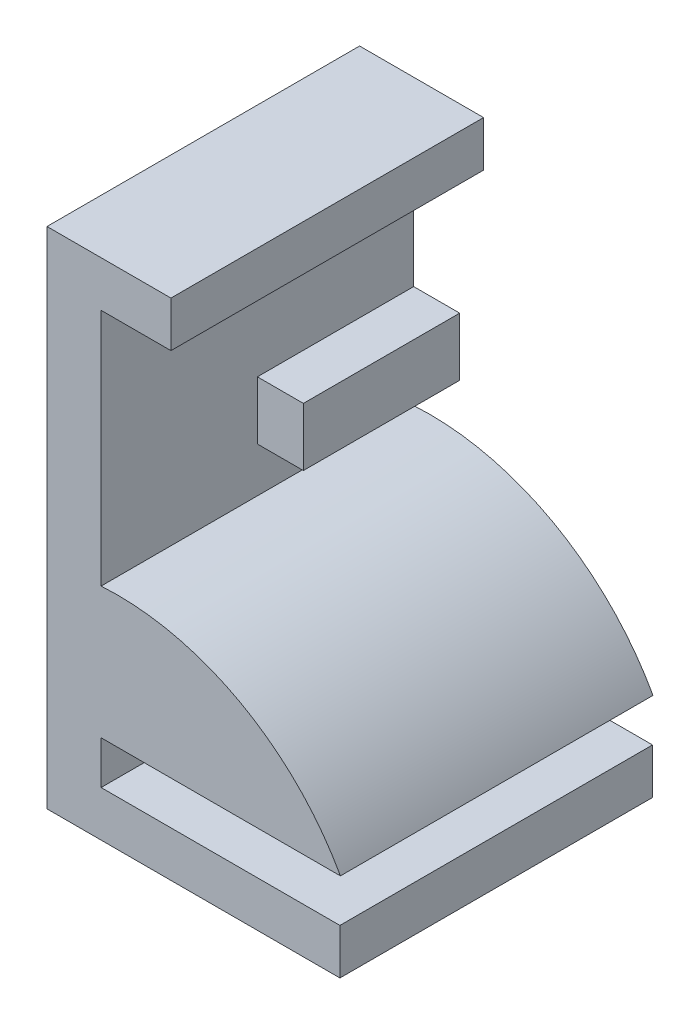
ISO-10303-21;
HEADER;
FILE_DESCRIPTION(('STEP AP214'),'2;1');
FILE_NAME('part.step','',(''),(''),'','','');
FILE_SCHEMA(('AUTOMOTIVE_DESIGN { 1 0 10303 214 1 1 1 1 }'));
ENDSEC;
DATA;
#1=APPLICATION_CONTEXT('core data for automotive mechanical design processes');
#2=APPLICATION_PROTOCOL_DEFINITION('international standard','automotive_design',2000,#1);
#3=PRODUCT_CONTEXT('',#1,'mechanical');
#4=PRODUCT('Part','Part','',(#3));
#5=PRODUCT_RELATED_PRODUCT_CATEGORY('part','',(#4));
#6=PRODUCT_DEFINITION_FORMATION('','',#4);
#7=PRODUCT_DEFINITION_CONTEXT('part definition',#1,'design');
#8=PRODUCT_DEFINITION('design','',#6,#7);
#9=PRODUCT_DEFINITION_SHAPE('','',#8);
#10=(LENGTH_UNIT() NAMED_UNIT(*) SI_UNIT(.MILLI.,.METRE.));
#11=(NAMED_UNIT(*) PLANE_ANGLE_UNIT() SI_UNIT($,.RADIAN.));
#12=(NAMED_UNIT(*) SI_UNIT($,.STERADIAN.) SOLID_ANGLE_UNIT());
#13=UNCERTAINTY_MEASURE_WITH_UNIT(LENGTH_MEASURE(1.E-05),#10,'distance_accuracy_value','');
#14=(GEOMETRIC_REPRESENTATION_CONTEXT(3) GLOBAL_UNCERTAINTY_ASSIGNED_CONTEXT((#13)) GLOBAL_UNIT_ASSIGNED_CONTEXT((#10,
#11,#12)) REPRESENTATION_CONTEXT('',''));
#15=CARTESIAN_POINT('',(0.,0.,0.));
#16=DIRECTION('',(0.,0.,1.));
#17=DIRECTION('',(1.,0.,0.));
#18=AXIS2_PLACEMENT_3D('',#15,#16,#17);
#19=CARTESIAN_POINT('',(152.004557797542,-86.5512105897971,47.5));
#20=DIRECTION('',(0.,1.,0.));
#21=DIRECTION('',(0.,0.,1.));
#22=AXIS2_PLACEMENT_3D('',#19,#20,#21);
#23=PLANE('',#22);
#24=DIRECTION('',(1.,0.,0.));
#25=VECTOR('',#24,1.);
#26=CARTESIAN_POINT('',(152.004557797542,-86.5512105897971,-47.5));
#27=LINE('',#26,#25);
#28=CARTESIAN_POINT('',(62.9855483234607,-86.5512105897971,-47.5));
#29=VERTEX_POINT('',#28);
#30=CARTESIAN_POINT('',(152.004557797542,-86.5512105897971,-47.5));
#31=VERTEX_POINT('',#30);
#32=EDGE_CURVE('E147',#29,#31,#27,.T.);
#33=ORIENTED_EDGE('',*,*,#32,.T.);
#34=DIRECTION('',(0.,0.,-1.));
#35=VECTOR('',#34,1.);
#36=CARTESIAN_POINT('',(152.004557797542,-86.5512105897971,47.5));
#37=LINE('',#36,#35);
#38=CARTESIAN_POINT('',(152.004557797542,-86.5512105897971,47.5));
#39=VERTEX_POINT('',#38);
#40=EDGE_CURVE('E11',#39,#31,#37,.T.);
#41=ORIENTED_EDGE('',*,*,#40,.F.);
#42=DIRECTION('',(1.,0.,0.));
#43=VECTOR('',#42,1.);
#44=CARTESIAN_POINT('',(152.004557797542,-86.5512105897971,47.5));
#45=LINE('',#44,#43);
#46=CARTESIAN_POINT('',(62.9855483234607,-86.5512105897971,47.5));
#47=VERTEX_POINT('',#46);
#48=EDGE_CURVE('E223',#47,#39,#45,.T.);
#49=ORIENTED_EDGE('',*,*,#48,.F.);
#50=DIRECTION('',(0.,0.,-1.));
#51=VECTOR('',#50,1.);
#52=CARTESIAN_POINT('',(62.9855483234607,-86.5512105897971,47.5));
#53=LINE('',#52,#51);
#54=EDGE_CURVE('E242',#47,#29,#53,.T.);
#55=ORIENTED_EDGE('',*,*,#54,.T.);
#56=EDGE_LOOP('',(#33,#41,#49,#55));
#57=FACE_BOUND('',#56,.T.);
#58=ADVANCED_FACE('F32',(#57),#23,.F.);
#59=CARTESIAN_POINT('',(152.004557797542,-86.5512105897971,47.5));
#60=DIRECTION('',(-1.,0.,0.));
#61=DIRECTION('',(0.,0.,1.));
#62=AXIS2_PLACEMENT_3D('',#59,#60,#61);
#63=PLANE('',#62);
#64=DIRECTION('',(0.,1.,0.));
#65=VECTOR('',#64,1.);
#66=CARTESIAN_POINT('',(152.004557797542,-86.5512105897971,-47.5));
#67=LINE('',#66,#65);
#68=CARTESIAN_POINT('',(152.004557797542,-72.710314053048,-47.5));
#69=VERTEX_POINT('',#68);
#70=EDGE_CURVE('E192',#31,#69,#67,.T.);
#71=ORIENTED_EDGE('',*,*,#70,.T.);
#72=DIRECTION('',(0.,0.,-1.));
#73=VECTOR('',#72,1.);
#74=CARTESIAN_POINT('',(152.004557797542,-72.710314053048,47.5));
#75=LINE('',#74,#73);
#76=CARTESIAN_POINT('',(152.004557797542,-72.710314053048,47.5));
#77=VERTEX_POINT('',#76);
#78=EDGE_CURVE('E39',#77,#69,#75,.T.);
#79=ORIENTED_EDGE('',*,*,#78,.F.);
#80=DIRECTION('',(0.,1.,0.));
#81=VECTOR('',#80,1.);
#82=CARTESIAN_POINT('',(152.004557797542,-86.5512105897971,47.5));
#83=LINE('',#82,#81);
#84=EDGE_CURVE('E225',#39,#77,#83,.T.);
#85=ORIENTED_EDGE('',*,*,#84,.F.);
#86=ORIENTED_EDGE('',*,*,#40,.T.);
#87=EDGE_LOOP('',(#71,#79,#85,#86));
#88=FACE_BOUND('',#87,.T.);
#89=ADVANCED_FACE('F292',(#88),#63,.F.);
#90=CARTESIAN_POINT('',(152.004557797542,-72.710314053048,47.5));
#91=DIRECTION('',(0.,-1.,0.));
#92=DIRECTION('',(1.,0.,0.));
#93=AXIS2_PLACEMENT_3D('',#90,#91,#92);
#94=PLANE('',#93);
#95=DIRECTION('',(-1.,0.,0.));
#96=VECTOR('',#95,1.);
#97=CARTESIAN_POINT('',(152.004557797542,-72.710314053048,-47.5));
#98=LINE('',#97,#96);
#99=CARTESIAN_POINT('',(79.4274220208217,-72.7103140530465,-47.5));
#100=VERTEX_POINT('',#99);
#101=EDGE_CURVE('E185',#69,#100,#98,.T.);
#102=ORIENTED_EDGE('',*,*,#101,.T.);
#103=DIRECTION('',(0.,0.,-1.));
#104=VECTOR('',#103,1.);
#105=CARTESIAN_POINT('',(79.4274220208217,-72.7103140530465,47.5));
#106=LINE('',#105,#104);
#107=CARTESIAN_POINT('',(79.4274220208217,-72.7103140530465,47.5));
#108=VERTEX_POINT('',#107);
#109=EDGE_CURVE('E176',#108,#100,#106,.T.);
#110=ORIENTED_EDGE('',*,*,#109,.F.);
#111=DIRECTION('',(-1.,0.,0.));
#112=VECTOR('',#111,1.);
#113=CARTESIAN_POINT('',(152.004557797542,-72.710314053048,47.5));
#114=LINE('',#113,#112);
#115=EDGE_CURVE('E186',#77,#108,#114,.T.);
#116=ORIENTED_EDGE('',*,*,#115,.F.);
#117=ORIENTED_EDGE('',*,*,#78,.T.);
#118=EDGE_LOOP('',(#102,#110,#116,#117));
#119=FACE_BOUND('',#118,.T.);
#120=ADVANCED_FACE('F183',(#119),#94,.F.);
#121=CARTESIAN_POINT('',(79.4274220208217,-72.7103140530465,47.5));
#122=DIRECTION('',(-1.,0.,0.));
#123=DIRECTION('',(0.,0.,1.));
#124=AXIS2_PLACEMENT_3D('',#121,#122,#123);
#125=PLANE('',#124);
#126=DIRECTION('',(0.,1.,0.));
#127=VECTOR('',#126,1.);
#128=CARTESIAN_POINT('',(79.4274220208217,-72.7103140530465,-47.5));
#129=LINE('',#128,#127);
#130=CARTESIAN_POINT('',(79.4274220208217,-59.6076484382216,-47.5));
#131=VERTEX_POINT('',#130);
#132=EDGE_CURVE('E194',#100,#131,#129,.T.);
#133=ORIENTED_EDGE('',*,*,#132,.T.);
#134=DIRECTION('',(0.,0.,-1.));
#135=VECTOR('',#134,1.);
#136=CARTESIAN_POINT('',(79.4274220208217,-59.6076484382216,47.5));
#137=LINE('',#136,#135);
#138=CARTESIAN_POINT('',(79.4274220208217,-59.6076484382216,47.5));
#139=VERTEX_POINT('',#138);
#140=EDGE_CURVE('E173',#139,#131,#137,.T.);
#141=ORIENTED_EDGE('',*,*,#140,.F.);
#142=DIRECTION('',(0.,1.,0.));
#143=VECTOR('',#142,1.);
#144=CARTESIAN_POINT('',(79.4274220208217,-72.7103140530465,47.5));
#145=LINE('',#144,#143);
#146=EDGE_CURVE('E228',#108,#139,#145,.T.);
#147=ORIENTED_EDGE('',*,*,#146,.F.);
#148=ORIENTED_EDGE('',*,*,#109,.T.);
#149=EDGE_LOOP('',(#133,#141,#147,#148));
#150=FACE_BOUND('',#149,.T.);
#151=ADVANCED_FACE('F289',(#150),#125,.F.);
#152=CARTESIAN_POINT('',(79.4274220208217,-59.6076484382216,47.5));
#153=DIRECTION('',(0.,1.,0.));
#154=DIRECTION('',(0.,0.,1.));
#155=AXIS2_PLACEMENT_3D('',#152,#153,#154);
#156=PLANE('',#155);
#157=DIRECTION('',(1.,0.,0.));
#158=VECTOR('',#157,1.);
#159=CARTESIAN_POINT('',(79.4274220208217,-59.6076484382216,-47.5));
#160=LINE('',#159,#158);
#161=CARTESIAN_POINT('',(152.150409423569,-59.6076484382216,-47.5));
#162=VERTEX_POINT('',#161);
#163=EDGE_CURVE('E196',#131,#162,#160,.T.);
#164=ORIENTED_EDGE('',*,*,#163,.T.);
#165=DIRECTION('',(0.,0.,-1.));
#166=VECTOR('',#165,1.);
#167=CARTESIAN_POINT('',(152.150409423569,-59.6076484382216,47.5));
#168=LINE('',#167,#166);
#169=CARTESIAN_POINT('',(152.150409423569,-59.6076484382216,47.5));
#170=VERTEX_POINT('',#169);
#171=EDGE_CURVE('E165',#170,#162,#168,.T.);
#172=ORIENTED_EDGE('',*,*,#171,.F.);
#173=DIRECTION('',(1.,0.,0.));
#174=VECTOR('',#173,1.);
#175=CARTESIAN_POINT('',(79.4274220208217,-59.6076484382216,47.5));
#176=LINE('',#175,#174);
#177=EDGE_CURVE('E230',#139,#170,#176,.T.);
#178=ORIENTED_EDGE('',*,*,#177,.F.);
#179=ORIENTED_EDGE('',*,*,#140,.T.);
#180=EDGE_LOOP('',(#164,#172,#178,#179));
#181=FACE_BOUND('',#180,.T.);
#182=ADVANCED_FACE('F285',(#181),#156,.F.);
#183=CARTESIAN_POINT('',(84.332901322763,-96.9649889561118,47.5));
#184=DIRECTION('',(0.,0.,-1.));
#185=DIRECTION('',(-1.,0.,0.));
#186=AXIS2_PLACEMENT_3D('',#183,#184,#185);
#187=CYLINDRICAL_SURFACE('',#186,77.4259988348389);
#188=CARTESIAN_POINT('',(84.332901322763,-96.9649889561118,-47.5));
#189=DIRECTION('',(0.,0.,1.));
#190=DIRECTION('',(-1.,0.,0.));
#191=AXIS2_PLACEMENT_3D('',#188,#189,#190);
#192=CIRCLE('',#191,77.4259988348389);
#193=CARTESIAN_POINT('',(79.4274220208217,-19.6945446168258,-47.5));
#194=VERTEX_POINT('',#193);
#195=EDGE_CURVE('E202',#162,#194,#192,.T.);
#196=ORIENTED_EDGE('',*,*,#195,.T.);
#197=DIRECTION('',(0.,0.,-1.));
#198=VECTOR('',#197,1.);
#199=CARTESIAN_POINT('',(79.4274220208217,-19.6945446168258,47.5));
#200=LINE('',#199,#198);
#201=CARTESIAN_POINT('',(79.4274220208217,-19.6945446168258,47.5));
#202=VERTEX_POINT('',#201);
#203=EDGE_CURVE('E163',#202,#194,#200,.T.);
#204=ORIENTED_EDGE('',*,*,#203,.F.);
#205=CARTESIAN_POINT('',(84.332901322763,-96.9649889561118,47.5));
#206=DIRECTION('',(0.,0.,1.));
#207=DIRECTION('',(-1.,0.,0.));
#208=AXIS2_PLACEMENT_3D('',#205,#206,#207);
#209=CIRCLE('',#208,77.4259988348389);
#210=EDGE_CURVE('E232',#170,#202,#209,.T.);
#211=ORIENTED_EDGE('',*,*,#210,.F.);
#212=ORIENTED_EDGE('',*,*,#171,.T.);
#213=EDGE_LOOP('',(#196,#204,#211,#212));
#214=FACE_BOUND('',#213,.T.);
#215=ADVANCED_FACE('F281',(#214),#187,.T.);
#216=CARTESIAN_POINT('',(79.4274220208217,-6.05335723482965,47.5));
#217=DIRECTION('',(0.,1.,0.));
#218=DIRECTION('',(0.,0.,1.));
#219=AXIS2_PLACEMENT_3D('',#216,#217,#218);
#220=PLANE('',#219);
#221=DIRECTION('',(0.,0.,-1.));
#222=VECTOR('',#221,1.);
#223=CARTESIAN_POINT('',(93.3999473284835,-6.05335723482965,47.5));
#224=LINE('',#223,#222);
#225=CARTESIAN_POINT('',(93.3999473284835,-6.05335723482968,0.));
#226=VERTEX_POINT('',#225);
#227=CARTESIAN_POINT('',(93.3999473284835,-6.05335723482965,-47.5));
#228=VERTEX_POINT('',#227);
#229=EDGE_CURVE('E156',#226,#228,#224,.T.);
#230=ORIENTED_EDGE('',*,*,#229,.F.);
#231=DIRECTION('',(1.,0.,0.));
#232=VECTOR('',#231,1.);
#233=CARTESIAN_POINT('',(79.4274220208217,-6.05335723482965,0.));
#234=LINE('',#233,#232);
#235=CARTESIAN_POINT('',(79.4274220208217,-6.05335723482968,0.));
#236=VERTEX_POINT('',#235);
#237=EDGE_CURVE('E140',#236,#226,#234,.T.);
#238=ORIENTED_EDGE('',*,*,#237,.F.);
#239=DIRECTION('',(0.,0.,-1.));
#240=VECTOR('',#239,1.);
#241=CARTESIAN_POINT('',(79.4274220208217,-6.05335723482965,47.5));
#242=LINE('',#241,#240);
#243=CARTESIAN_POINT('',(79.4274220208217,-6.05335723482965,-47.5));
#244=VERTEX_POINT('',#243);
#245=EDGE_CURVE('E154',#236,#244,#242,.T.);
#246=ORIENTED_EDGE('',*,*,#245,.T.);
#247=DIRECTION('',(1.,0.,0.));
#248=VECTOR('',#247,1.);
#249=CARTESIAN_POINT('',(79.4274220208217,-6.05335723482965,-47.5));
#250=LINE('',#249,#248);
#251=EDGE_CURVE('E205',#244,#228,#250,.T.);
#252=ORIENTED_EDGE('',*,*,#251,.T.);
#253=EDGE_LOOP('',(#230,#238,#246,#252));
#254=FACE_BOUND('',#253,.T.);
#255=ADVANCED_FACE('F152',(#254),#220,.F.);
#256=CARTESIAN_POINT('',(93.3999473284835,-6.05335723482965,47.5));
#257=DIRECTION('',(-1.,0.,0.));
#258=DIRECTION('',(0.,0.,1.));
#259=AXIS2_PLACEMENT_3D('',#256,#257,#258);
#260=PLANE('',#259);
#261=DIRECTION('',(0.,0.,-1.));
#262=VECTOR('',#261,1.);
#263=CARTESIAN_POINT('',(93.3999473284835,11.6296634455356,47.5));
#264=LINE('',#263,#262);
#265=CARTESIAN_POINT('',(93.3999473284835,11.6296634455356,0.));
#266=VERTEX_POINT('',#265);
#267=CARTESIAN_POINT('',(93.3999473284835,11.6296634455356,-47.5));
#268=VERTEX_POINT('',#267);
#269=EDGE_CURVE('E167',#266,#268,#264,.T.);
#270=ORIENTED_EDGE('',*,*,#269,.F.);
#271=DIRECTION('',(0.,1.,0.));
#272=VECTOR('',#271,1.);
#273=CARTESIAN_POINT('',(93.3999473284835,-86.5522105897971,0.));
#274=LINE('',#273,#272);
#275=EDGE_CURVE('E148',#226,#266,#274,.T.);
#276=ORIENTED_EDGE('',*,*,#275,.F.);
#277=ORIENTED_EDGE('',*,*,#229,.T.);
#278=DIRECTION('',(0.,1.,0.));
#279=VECTOR('',#278,1.);
#280=CARTESIAN_POINT('',(93.3999473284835,-6.05335723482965,-47.5));
#281=LINE('',#280,#279);
#282=EDGE_CURVE('E207',#228,#268,#281,.T.);
#283=ORIENTED_EDGE('',*,*,#282,.T.);
#284=EDGE_LOOP('',(#270,#276,#277,#283));
#285=FACE_BOUND('',#284,.T.);
#286=ADVANCED_FACE('F265',(#285),#260,.F.);
#287=CARTESIAN_POINT('',(93.3999473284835,11.6296634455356,47.5));
#288=DIRECTION('',(0.,-1.,0.));
#289=DIRECTION('',(0.,0.,-1.));
#290=AXIS2_PLACEMENT_3D('',#287,#288,#289);
#291=PLANE('',#290);
#292=DIRECTION('',(0.,0.,-1.));
#293=VECTOR('',#292,1.);
#294=CARTESIAN_POINT('',(79.4274220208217,11.6296634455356,47.5));
#295=LINE('',#294,#293);
#296=CARTESIAN_POINT('',(79.4274220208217,11.6296634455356,0.));
#297=VERTEX_POINT('',#296);
#298=CARTESIAN_POINT('',(79.4274220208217,11.6296634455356,-47.5));
#299=VERTEX_POINT('',#298);
#300=EDGE_CURVE('E257',#297,#299,#295,.T.);
#301=ORIENTED_EDGE('',*,*,#300,.F.);
#302=DIRECTION('',(-1.,0.,0.));
#303=VECTOR('',#302,1.);
#304=CARTESIAN_POINT('',(79.4274220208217,11.6296634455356,0.));
#305=LINE('',#304,#303);
#306=EDGE_CURVE('E143',#266,#297,#305,.T.);
#307=ORIENTED_EDGE('',*,*,#306,.F.);
#308=ORIENTED_EDGE('',*,*,#269,.T.);
#309=DIRECTION('',(-1.,0.,0.));
#310=VECTOR('',#309,1.);
#311=CARTESIAN_POINT('',(93.3999473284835,11.6296634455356,-47.5));
#312=LINE('',#311,#310);
#313=EDGE_CURVE('E210',#268,#299,#312,.T.);
#314=ORIENTED_EDGE('',*,*,#313,.T.);
#315=EDGE_LOOP('',(#301,#307,#308,#314));
#316=FACE_BOUND('',#315,.T.);
#317=ADVANCED_FACE('F260',(#316),#291,.F.);
#318=CARTESIAN_POINT('',(79.4274220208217,11.6296634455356,47.5));
#319=DIRECTION('',(-1.,0.,0.));
#320=DIRECTION('',(0.,0.,1.));
#321=AXIS2_PLACEMENT_3D('',#318,#319,#320);
#322=PLANE('',#321);
#323=DIRECTION('',(0.,1.,0.));
#324=VECTOR('',#323,1.);
#325=CARTESIAN_POINT('',(79.4274220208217,11.6296634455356,-47.5));
#326=LINE('',#325,#324);
#327=CARTESIAN_POINT('',(79.4274220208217,52.8867530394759,-47.5));
#328=VERTEX_POINT('',#327);
#329=EDGE_CURVE('E213',#299,#328,#326,.T.);
#330=ORIENTED_EDGE('',*,*,#329,.T.);
#331=DIRECTION('',(0.,0.,-1.));
#332=VECTOR('',#331,1.);
#333=CARTESIAN_POINT('',(79.4274220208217,52.8867530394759,47.5));
#334=LINE('',#333,#332);
#335=CARTESIAN_POINT('',(79.4274220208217,52.8867530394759,47.5));
#336=VERTEX_POINT('',#335);
#337=EDGE_CURVE('E254',#336,#328,#334,.T.);
#338=ORIENTED_EDGE('',*,*,#337,.F.);
#339=DIRECTION('',(0.,1.,0.));
#340=VECTOR('',#339,1.);
#341=CARTESIAN_POINT('',(79.4274220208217,-19.6945446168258,47.5));
#342=LINE('',#341,#340);
#343=EDGE_CURVE('E234',#202,#336,#342,.T.);
#344=ORIENTED_EDGE('',*,*,#343,.F.);
#345=ORIENTED_EDGE('',*,*,#203,.T.);
#346=DIRECTION('',(0.,1.,0.));
#347=VECTOR('',#346,1.);
#348=CARTESIAN_POINT('',(79.4274220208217,-19.6945446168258,-47.5));
#349=LINE('',#348,#347);
#350=EDGE_CURVE('E161',#194,#244,#349,.T.);
#351=ORIENTED_EDGE('',*,*,#350,.T.);
#352=ORIENTED_EDGE('',*,*,#245,.F.);
#353=DIRECTION('',(0.,1.,0.));
#354=VECTOR('',#353,1.);
#355=CARTESIAN_POINT('',(79.4274220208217,-86.5522105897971,0.));
#356=LINE('',#355,#354);
#357=EDGE_CURVE('E137',#236,#297,#356,.T.);
#358=ORIENTED_EDGE('',*,*,#357,.T.);
#359=ORIENTED_EDGE('',*,*,#300,.T.);
#360=EDGE_LOOP('',(#330,#338,#344,#345,#351,#352,#358,#359));
#361=FACE_BOUND('',#360,.T.);
#362=ADVANCED_FACE('F158',(#361),#322,.F.);
#363=CARTESIAN_POINT('',(79.4274220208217,52.8867530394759,47.5));
#364=DIRECTION('',(0.,1.,0.));
#365=DIRECTION('',(0.,0.,1.));
#366=AXIS2_PLACEMENT_3D('',#363,#364,#365);
#367=PLANE('',#366);
#368=DIRECTION('',(1.,0.,0.));
#369=VECTOR('',#368,1.);
#370=CARTESIAN_POINT('',(79.4274220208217,52.8867530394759,-47.5));
#371=LINE('',#370,#369);
#372=CARTESIAN_POINT('',(100.6545595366,52.8867530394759,-47.5));
#373=VERTEX_POINT('',#372);
#374=EDGE_CURVE('E215',#328,#373,#371,.T.);
#375=ORIENTED_EDGE('',*,*,#374,.T.);
#376=DIRECTION('',(0.,0.,-1.));
#377=VECTOR('',#376,1.);
#378=CARTESIAN_POINT('',(100.6545595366,52.8867530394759,47.5));
#379=LINE('',#378,#377);
#380=CARTESIAN_POINT('',(100.6545595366,52.8867530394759,47.5));
#381=VERTEX_POINT('',#380);
#382=EDGE_CURVE('E251',#381,#373,#379,.T.);
#383=ORIENTED_EDGE('',*,*,#382,.F.);
#384=DIRECTION('',(1.,0.,0.));
#385=VECTOR('',#384,1.);
#386=CARTESIAN_POINT('',(79.4274220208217,52.8867530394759,47.5));
#387=LINE('',#386,#385);
#388=EDGE_CURVE('E236',#336,#381,#387,.T.);
#389=ORIENTED_EDGE('',*,*,#388,.F.);
#390=ORIENTED_EDGE('',*,*,#337,.T.);
#391=EDGE_LOOP('',(#375,#383,#389,#390));
#392=FACE_BOUND('',#391,.T.);
#393=ADVANCED_FACE('F272',(#392),#367,.F.);
#394=CARTESIAN_POINT('',(100.6545595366,52.8867530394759,47.5));
#395=DIRECTION('',(-1.,0.,0.));
#396=DIRECTION('',(0.,0.,1.));
#397=AXIS2_PLACEMENT_3D('',#394,#395,#396);
#398=PLANE('',#397);
#399=DIRECTION('',(0.,1.,0.));
#400=VECTOR('',#399,1.);
#401=CARTESIAN_POINT('',(100.6545595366,52.8867530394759,-47.5));
#402=LINE('',#401,#400);
#403=CARTESIAN_POINT('',(100.6545595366,66.7276495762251,-47.5));
#404=VERTEX_POINT('',#403);
#405=EDGE_CURVE('E217',#373,#404,#402,.T.);
#406=ORIENTED_EDGE('',*,*,#405,.T.);
#407=DIRECTION('',(0.,0.,-1.));
#408=VECTOR('',#407,1.);
#409=CARTESIAN_POINT('',(100.6545595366,66.7276495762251,47.5));
#410=LINE('',#409,#408);
#411=CARTESIAN_POINT('',(100.6545595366,66.7276495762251,47.5));
#412=VERTEX_POINT('',#411);
#413=EDGE_CURVE('E248',#412,#404,#410,.T.);
#414=ORIENTED_EDGE('',*,*,#413,.F.);
#415=DIRECTION('',(0.,1.,0.));
#416=VECTOR('',#415,1.);
#417=CARTESIAN_POINT('',(100.6545595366,52.8867530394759,47.5));
#418=LINE('',#417,#416);
#419=EDGE_CURVE('E238',#381,#412,#418,.T.);
#420=ORIENTED_EDGE('',*,*,#419,.F.);
#421=ORIENTED_EDGE('',*,*,#382,.T.);
#422=EDGE_LOOP('',(#406,#414,#420,#421));
#423=FACE_BOUND('',#422,.T.);
#424=ADVANCED_FACE('F304',(#423),#398,.F.);
#425=CARTESIAN_POINT('',(62.9855483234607,66.7276495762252,47.5));
#426=DIRECTION('',(0.,-1.,0.));
#427=DIRECTION('',(1.,0.,0.));
#428=AXIS2_PLACEMENT_3D('',#425,#426,#427);
#429=PLANE('',#428);
#430=DIRECTION('',(-1.,0.,0.));
#431=VECTOR('',#430,1.);
#432=CARTESIAN_POINT('',(62.9855483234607,66.7276495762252,-47.5));
#433=LINE('',#432,#431);
#434=CARTESIAN_POINT('',(62.9855483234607,66.7276495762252,-47.5));
#435=VERTEX_POINT('',#434);
#436=EDGE_CURVE('E219',#404,#435,#433,.T.);
#437=ORIENTED_EDGE('',*,*,#436,.T.);
#438=DIRECTION('',(0.,0.,-1.));
#439=VECTOR('',#438,1.);
#440=CARTESIAN_POINT('',(62.9855483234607,66.7276495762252,47.5));
#441=LINE('',#440,#439);
#442=CARTESIAN_POINT('',(62.9855483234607,66.7276495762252,47.5));
#443=VERTEX_POINT('',#442);
#444=EDGE_CURVE('E245',#443,#435,#441,.T.);
#445=ORIENTED_EDGE('',*,*,#444,.F.);
#446=DIRECTION('',(-1.,0.,0.));
#447=VECTOR('',#446,1.);
#448=CARTESIAN_POINT('',(62.9855483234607,66.7276495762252,47.5));
#449=LINE('',#448,#447);
#450=EDGE_CURVE('E51',#412,#443,#449,.T.);
#451=ORIENTED_EDGE('',*,*,#450,.F.);
#452=ORIENTED_EDGE('',*,*,#413,.T.);
#453=EDGE_LOOP('',(#437,#445,#451,#452));
#454=FACE_BOUND('',#453,.T.);
#455=ADVANCED_FACE('F302',(#454),#429,.F.);
#456=CARTESIAN_POINT('',(62.9855483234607,-86.5512105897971,47.5));
#457=DIRECTION('',(1.,0.,0.));
#458=DIRECTION('',(0.,1.,0.));
#459=AXIS2_PLACEMENT_3D('',#456,#457,#458);
#460=PLANE('',#459);
#461=DIRECTION('',(0.,-1.,0.));
#462=VECTOR('',#461,1.);
#463=CARTESIAN_POINT('',(62.9855483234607,-86.5512105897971,-47.5));
#464=LINE('',#463,#462);
#465=EDGE_CURVE('E221',#435,#29,#464,.T.);
#466=ORIENTED_EDGE('',*,*,#465,.T.);
#467=ORIENTED_EDGE('',*,*,#54,.F.);
#468=DIRECTION('',(0.,-1.,0.));
#469=VECTOR('',#468,1.);
#470=CARTESIAN_POINT('',(62.9855483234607,-86.5512105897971,47.5));
#471=LINE('',#470,#469);
#472=EDGE_CURVE('E46',#443,#47,#471,.T.);
#473=ORIENTED_EDGE('',*,*,#472,.F.);
#474=ORIENTED_EDGE('',*,*,#444,.T.);
#475=EDGE_LOOP('',(#466,#467,#473,#474));
#476=FACE_BOUND('',#475,.T.);
#477=ADVANCED_FACE('F300',(#476),#460,.F.);
#478=CARTESIAN_POINT('',(84.332901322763,-96.9649889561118,47.5));
#479=DIRECTION('',(0.,0.,-1.));
#480=DIRECTION('',(-1.,0.,0.));
#481=AXIS2_PLACEMENT_3D('',#478,#479,#480);
#482=PLANE('',#481);
#483=ORIENTED_EDGE('',*,*,#343,.T.);
#484=ORIENTED_EDGE('',*,*,#388,.T.);
#485=ORIENTED_EDGE('',*,*,#419,.T.);
#486=ORIENTED_EDGE('',*,*,#450,.T.);
#487=ORIENTED_EDGE('',*,*,#472,.T.);
#488=ORIENTED_EDGE('',*,*,#48,.T.);
#489=ORIENTED_EDGE('',*,*,#84,.T.);
#490=ORIENTED_EDGE('',*,*,#115,.T.);
#491=ORIENTED_EDGE('',*,*,#146,.T.);
#492=ORIENTED_EDGE('',*,*,#177,.T.);
#493=ORIENTED_EDGE('',*,*,#210,.T.);
#494=EDGE_LOOP('',(#483,#484,#485,#486,#487,#488,#489,#490,#491,#492,#493));
#495=FACE_BOUND('',#494,.T.);
#496=ADVANCED_FACE('F275',(#495),#482,.F.);
#497=CARTESIAN_POINT('',(84.332901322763,-96.9649889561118,-47.5));
#498=DIRECTION('',(0.,0.,-1.));
#499=DIRECTION('',(-1.,0.,0.));
#500=AXIS2_PLACEMENT_3D('',#497,#498,#499);
#501=PLANE('',#500);
#502=ORIENTED_EDGE('',*,*,#32,.F.);
#503=ORIENTED_EDGE('',*,*,#465,.F.);
#504=ORIENTED_EDGE('',*,*,#436,.F.);
#505=ORIENTED_EDGE('',*,*,#405,.F.);
#506=ORIENTED_EDGE('',*,*,#374,.F.);
#507=ORIENTED_EDGE('',*,*,#329,.F.);
#508=ORIENTED_EDGE('',*,*,#313,.F.);
#509=ORIENTED_EDGE('',*,*,#282,.F.);
#510=ORIENTED_EDGE('',*,*,#251,.F.);
#511=ORIENTED_EDGE('',*,*,#350,.F.);
#512=ORIENTED_EDGE('',*,*,#195,.F.);
#513=ORIENTED_EDGE('',*,*,#163,.F.);
#514=ORIENTED_EDGE('',*,*,#132,.F.);
#515=ORIENTED_EDGE('',*,*,#101,.F.);
#516=ORIENTED_EDGE('',*,*,#70,.F.);
#517=EDGE_LOOP('',(#502,#503,#504,#505,#506,#507,#508,#509,#510,#511,#512,#513,#514,#515,#516));
#518=FACE_BOUND('',#517,.T.);
#519=ADVANCED_FACE('F191',(#518),#501,.T.);
#520=CARTESIAN_POINT('',(79.4274220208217,-86.5522105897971,0.));
#521=DIRECTION('',(0.,0.,-1.));
#522=DIRECTION('',(-1.,0.,0.));
#523=AXIS2_PLACEMENT_3D('',#520,#521,#522);
#524=PLANE('',#523);
#525=ORIENTED_EDGE('',*,*,#237,.T.);
#526=ORIENTED_EDGE('',*,*,#275,.T.);
#527=ORIENTED_EDGE('',*,*,#306,.T.);
#528=ORIENTED_EDGE('',*,*,#357,.F.);
#529=EDGE_LOOP('',(#525,#526,#527,#528));
#530=FACE_BOUND('',#529,.T.);
#531=ADVANCED_FACE('F139',(#530),#524,.F.);
#532=CLOSED_SHELL('',(#58,#89,#120,#151,#182,#215,#255,#286,#317,#362,#393,#424,#455,#477,#496,
#519,#531));
#533=MANIFOLD_SOLID_BREP('B2',#532);
#534=ADVANCED_BREP_SHAPE_REPRESENTATION('',(#18,#533),#14);
#535=SHAPE_DEFINITION_REPRESENTATION(#9,#534);
ENDSEC;
END-ISO-10303-21;
